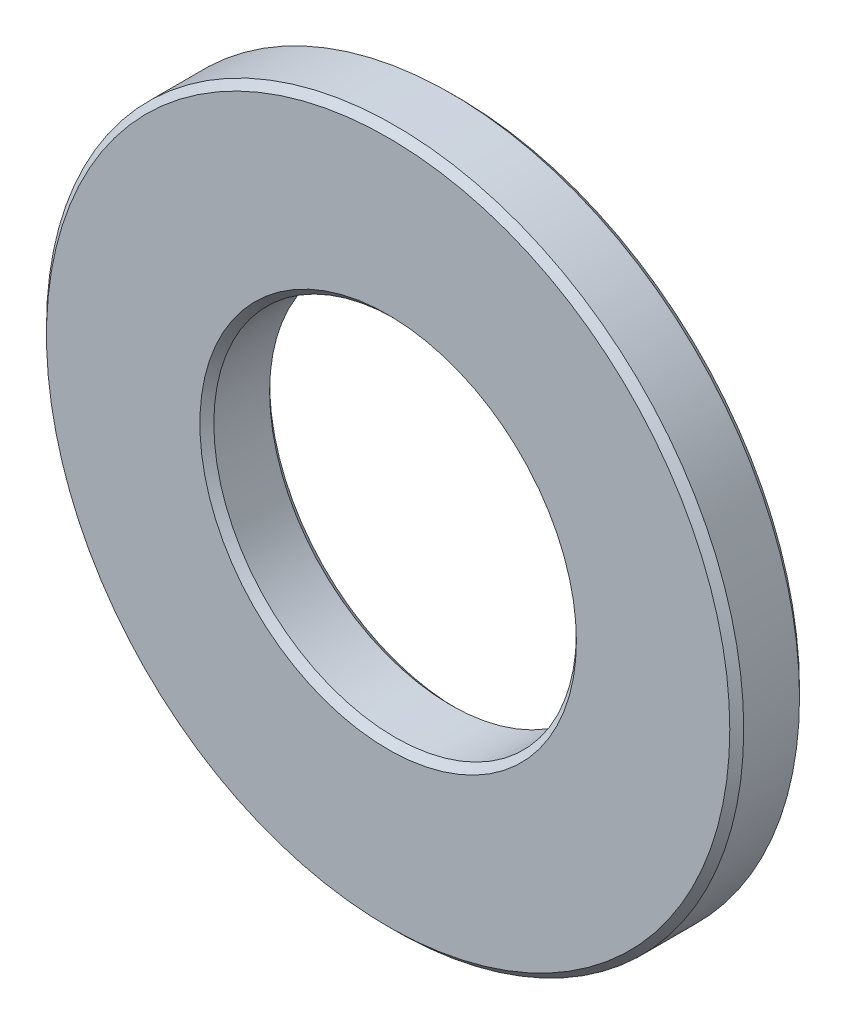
from build123d import *

# Parameters (mm, degrees)
SKETCH1_R           = 5
SKETCH1_R_2         = 2.6
BOSS_EXTRUDE2_DEPTH = 0.5
CHAMFER3_SIZE       = 0.1


with BuildPart() as part:
    # Sketch1 → Boss-Extrude2 (new, symmetric)
    with BuildSketch(Plane.XY):
        Circle(SKETCH1_R)
        Circle(SKETCH1_R_2, mode=Mode.SUBTRACT)
    extrude(amount=BOSS_EXTRUDE2_DEPTH, both=True)

    # Chamfer3
    chamfer3_edges = [part.edges().sort_by_distance(p)[0] for p in [
        (-5, 0, -0.5),
        (-5, 0, 0.5),
        (-2.6, 0, -0.5),
        (-2.6, 0, 0.5),
    ]]
    chamfer(chamfer3_edges, length=CHAMFER3_SIZE)


solid = part.part
